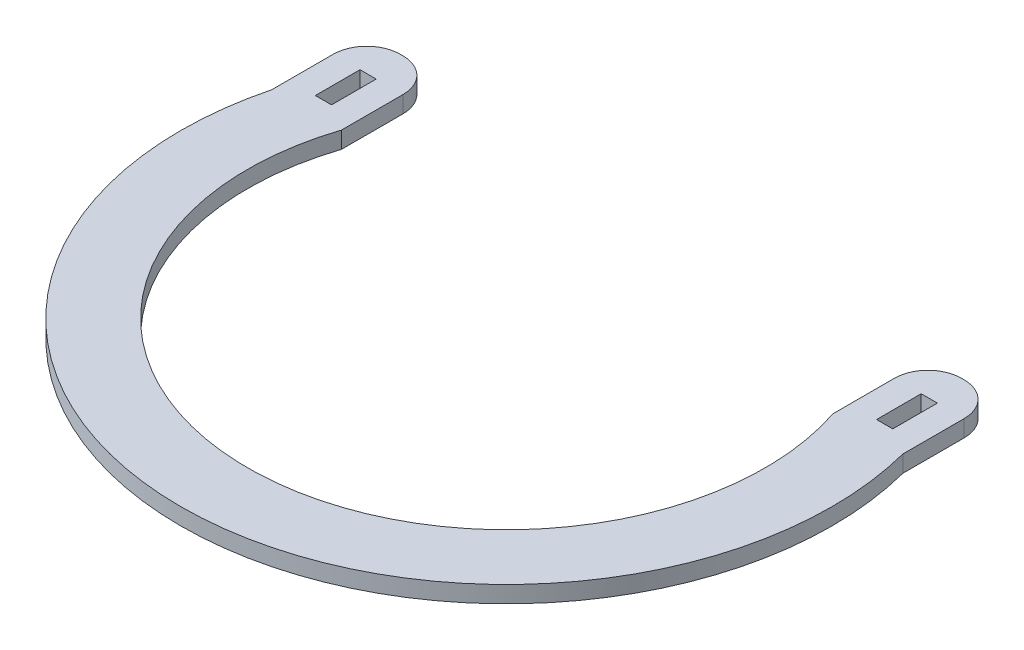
ISO-10303-21;
HEADER;
FILE_DESCRIPTION(('STEP AP214'),'2;1');
FILE_NAME('part.step','',(''),(''),'','','');
FILE_SCHEMA(('AUTOMOTIVE_DESIGN { 1 0 10303 214 1 1 1 1 }'));
ENDSEC;
DATA;
#1=APPLICATION_CONTEXT('core data for automotive mechanical design processes');
#2=APPLICATION_PROTOCOL_DEFINITION('international standard','automotive_design',2000,#1);
#3=PRODUCT_CONTEXT('',#1,'mechanical');
#4=PRODUCT('Part','Part','',(#3));
#5=PRODUCT_RELATED_PRODUCT_CATEGORY('part','',(#4));
#6=PRODUCT_DEFINITION_FORMATION('','',#4);
#7=PRODUCT_DEFINITION_CONTEXT('part definition',#1,'design');
#8=PRODUCT_DEFINITION('design','',#6,#7);
#9=PRODUCT_DEFINITION_SHAPE('','',#8);
#10=(LENGTH_UNIT() NAMED_UNIT(*) SI_UNIT(.MILLI.,.METRE.));
#11=(NAMED_UNIT(*) PLANE_ANGLE_UNIT() SI_UNIT($,.RADIAN.));
#12=(NAMED_UNIT(*) SI_UNIT($,.STERADIAN.) SOLID_ANGLE_UNIT());
#13=UNCERTAINTY_MEASURE_WITH_UNIT(LENGTH_MEASURE(1.E-05),#10,'distance_accuracy_value','');
#14=(GEOMETRIC_REPRESENTATION_CONTEXT(3) GLOBAL_UNCERTAINTY_ASSIGNED_CONTEXT((#13)) GLOBAL_UNIT_ASSIGNED_CONTEXT((#10,
#11,#12)) REPRESENTATION_CONTEXT('',''));
#15=CARTESIAN_POINT('',(0.,0.,0.));
#16=DIRECTION('',(0.,0.,1.));
#17=DIRECTION('',(1.,0.,0.));
#18=AXIS2_PLACEMENT_3D('',#15,#16,#17);
#19=CARTESIAN_POINT('',(0.,3.,14.4840771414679));
#20=DIRECTION('',(0.,1.,0.));
#21=DIRECTION('',(0.,0.,1.));
#22=AXIS2_PLACEMENT_3D('',#19,#20,#21);
#23=PLANE('',#22);
#24=CARTESIAN_POINT('',(0.,3.,14.4840771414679));
#25=DIRECTION('',(0.,-1.,0.));
#26=DIRECTION('',(0.,0.,1.));
#27=AXIS2_PLACEMENT_3D('',#24,#25,#26);
#28=CIRCLE('',#27,46.322656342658);
#29=CARTESIAN_POINT('',(44.,3.,0.));
#30=VERTEX_POINT('',#29);
#31=CARTESIAN_POINT('',(-44.,3.,0.));
#32=VERTEX_POINT('',#31);
#33=EDGE_CURVE('E237',#30,#32,#28,.T.);
#34=ORIENTED_EDGE('',*,*,#33,.T.);
#35=DIRECTION('',(0.,0.,-1.));
#36=VECTOR('',#35,1.);
#37=CARTESIAN_POINT('',(-44.,3.,0.));
#38=LINE('',#37,#36);
#39=CARTESIAN_POINT('',(-44.,3.,-11.));
#40=VERTEX_POINT('',#39);
#41=EDGE_CURVE('E240',#32,#40,#38,.T.);
#42=ORIENTED_EDGE('',*,*,#41,.T.);
#43=CARTESIAN_POINT('',(-50.,3.,-11.));
#44=DIRECTION('',(0.,1.,0.));
#45=DIRECTION('',(0.,0.,1.));
#46=AXIS2_PLACEMENT_3D('',#43,#44,#45);
#47=CIRCLE('',#46,6.);
#48=CARTESIAN_POINT('',(-50.,3.,-17.));
#49=VERTEX_POINT('',#48);
#50=EDGE_CURVE('E243',#40,#49,#47,.T.);
#51=ORIENTED_EDGE('',*,*,#50,.T.);
#52=DIRECTION('',(-1.,0.,0.));
#53=VECTOR('',#52,1.);
#54=CARTESIAN_POINT('',(-50.4955197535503,3.,-17.));
#55=LINE('',#54,#53);
#56=CARTESIAN_POINT('',(-50.4955197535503,3.,-17.));
#57=VERTEX_POINT('',#56);
#58=EDGE_CURVE('E245',#49,#57,#55,.T.);
#59=ORIENTED_EDGE('',*,*,#58,.T.);
#60=CARTESIAN_POINT('',(-50.4955197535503,3.,-11.));
#61=DIRECTION('',(0.,1.,0.));
#62=DIRECTION('',(0.,0.,-1.));
#63=AXIS2_PLACEMENT_3D('',#60,#61,#62);
#64=CIRCLE('',#63,6.);
#65=CARTESIAN_POINT('',(-56.4955197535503,3.,-11.));
#66=VERTEX_POINT('',#65);
#67=EDGE_CURVE('E247',#57,#66,#64,.T.);
#68=ORIENTED_EDGE('',*,*,#67,.T.);
#69=DIRECTION('',(0.,0.,1.));
#70=VECTOR('',#69,1.);
#71=CARTESIAN_POINT('',(-56.4955197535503,3.,0.));
#72=LINE('',#71,#70);
#73=CARTESIAN_POINT('',(-56.4955197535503,3.,0.));
#74=VERTEX_POINT('',#73);
#75=EDGE_CURVE('E249',#66,#74,#72,.T.);
#76=ORIENTED_EDGE('',*,*,#75,.T.);
#77=CARTESIAN_POINT('',(0.,3.,14.4840771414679));
#78=DIRECTION('',(0.,1.,0.));
#79=DIRECTION('',(0.,0.,1.));
#80=AXIS2_PLACEMENT_3D('',#77,#78,#79);
#81=CIRCLE('',#80,58.322656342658);
#82=CARTESIAN_POINT('',(56.4955197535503,3.,0.));
#83=VERTEX_POINT('',#82);
#84=EDGE_CURVE('E251',#74,#83,#81,.T.);
#85=ORIENTED_EDGE('',*,*,#84,.T.);
#86=DIRECTION('',(0.,0.,-1.));
#87=VECTOR('',#86,1.);
#88=CARTESIAN_POINT('',(56.4955197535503,3.,0.));
#89=LINE('',#88,#87);
#90=CARTESIAN_POINT('',(56.4955197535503,3.,-11.));
#91=VERTEX_POINT('',#90);
#92=EDGE_CURVE('E253',#83,#91,#89,.T.);
#93=ORIENTED_EDGE('',*,*,#92,.T.);
#94=CARTESIAN_POINT('',(50.4955197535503,3.,-11.));
#95=DIRECTION('',(0.,1.,0.));
#96=DIRECTION('',(0.,0.,1.));
#97=AXIS2_PLACEMENT_3D('',#94,#95,#96);
#98=CIRCLE('',#97,6.);
#99=CARTESIAN_POINT('',(50.4955197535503,3.,-17.));
#100=VERTEX_POINT('',#99);
#101=EDGE_CURVE('E255',#91,#100,#98,.T.);
#102=ORIENTED_EDGE('',*,*,#101,.T.);
#103=DIRECTION('',(-1.,0.,0.));
#104=VECTOR('',#103,1.);
#105=CARTESIAN_POINT('',(50.4955197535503,3.,-17.));
#106=LINE('',#105,#104);
#107=CARTESIAN_POINT('',(50.,3.,-17.));
#108=VERTEX_POINT('',#107);
#109=EDGE_CURVE('E257',#100,#108,#106,.T.);
#110=ORIENTED_EDGE('',*,*,#109,.T.);
#111=CARTESIAN_POINT('',(50.,3.,-11.));
#112=DIRECTION('',(0.,1.,0.));
#113=DIRECTION('',(0.,0.,-1.));
#114=AXIS2_PLACEMENT_3D('',#111,#112,#113);
#115=CIRCLE('',#114,6.);
#116=CARTESIAN_POINT('',(44.,3.,-11.));
#117=VERTEX_POINT('',#116);
#118=EDGE_CURVE('E259',#108,#117,#115,.T.);
#119=ORIENTED_EDGE('',*,*,#118,.T.);
#120=DIRECTION('',(0.,0.,1.));
#121=VECTOR('',#120,1.);
#122=CARTESIAN_POINT('',(44.,3.,0.));
#123=LINE('',#122,#121);
#124=EDGE_CURVE('E261',#117,#30,#123,.T.);
#125=ORIENTED_EDGE('',*,*,#124,.T.);
#126=EDGE_LOOP('',(#34,#42,#51,#59,#68,#76,#85,#93,#102,#110,#119,#125));
#127=FACE_BOUND('',#126,.T.);
#128=DIRECTION('',(-1.,0.,0.));
#129=VECTOR('',#128,1.);
#130=CARTESIAN_POINT('',(-51.6977598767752,3.,-11.));
#131=LINE('',#130,#129);
#132=CARTESIAN_POINT('',(-48.7977598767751,3.,-11.));
#133=VERTEX_POINT('',#132);
#134=CARTESIAN_POINT('',(-51.6977598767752,3.,-11.));
#135=VERTEX_POINT('',#134);
#136=EDGE_CURVE('E208',#133,#135,#131,.T.);
#137=ORIENTED_EDGE('',*,*,#136,.F.);
#138=DIRECTION('',(0.,0.,-1.));
#139=VECTOR('',#138,1.);
#140=CARTESIAN_POINT('',(-48.7977598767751,3.,-11.));
#141=LINE('',#140,#139);
#142=CARTESIAN_POINT('',(-48.7977598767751,3.,-3.));
#143=VERTEX_POINT('',#142);
#144=EDGE_CURVE('E206',#143,#133,#141,.T.);
#145=ORIENTED_EDGE('',*,*,#144,.F.);
#146=DIRECTION('',(1.,0.,0.));
#147=VECTOR('',#146,1.);
#148=CARTESIAN_POINT('',(-51.6977598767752,3.,-3.));
#149=LINE('',#148,#147);
#150=CARTESIAN_POINT('',(-51.6977598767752,3.,-3.));
#151=VERTEX_POINT('',#150);
#152=EDGE_CURVE('E214',#151,#143,#149,.T.);
#153=ORIENTED_EDGE('',*,*,#152,.F.);
#154=DIRECTION('',(0.,0.,1.));
#155=VECTOR('',#154,1.);
#156=CARTESIAN_POINT('',(-51.6977598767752,3.,-11.));
#157=LINE('',#156,#155);
#158=EDGE_CURVE('E211',#135,#151,#157,.T.);
#159=ORIENTED_EDGE('',*,*,#158,.F.);
#160=EDGE_LOOP('',(#137,#145,#153,#159));
#161=FACE_BOUND('',#160,.T.);
#162=DIRECTION('',(-1.,0.,0.));
#163=VECTOR('',#162,1.);
#164=CARTESIAN_POINT('',(51.6977598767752,3.,-11.));
#165=LINE('',#164,#163);
#166=CARTESIAN_POINT('',(51.6977598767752,3.,-11.));
#167=VERTEX_POINT('',#166);
#168=CARTESIAN_POINT('',(48.7977598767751,3.,-11.));
#169=VERTEX_POINT('',#168);
#170=EDGE_CURVE('E178',#167,#169,#165,.T.);
#171=ORIENTED_EDGE('',*,*,#170,.F.);
#172=DIRECTION('',(0.,0.,-1.));
#173=VECTOR('',#172,1.);
#174=CARTESIAN_POINT('',(51.6977598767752,3.,-11.));
#175=LINE('',#174,#173);
#176=CARTESIAN_POINT('',(51.6977598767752,3.,-3.));
#177=VERTEX_POINT('',#176);
#178=EDGE_CURVE('E170',#177,#167,#175,.T.);
#179=ORIENTED_EDGE('',*,*,#178,.F.);
#180=DIRECTION('',(1.,0.,0.));
#181=VECTOR('',#180,1.);
#182=CARTESIAN_POINT('',(51.6977598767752,3.,-3.));
#183=LINE('',#182,#181);
#184=CARTESIAN_POINT('',(48.7977598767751,3.,-3.));
#185=VERTEX_POINT('',#184);
#186=EDGE_CURVE('E192',#185,#177,#183,.T.);
#187=ORIENTED_EDGE('',*,*,#186,.F.);
#188=DIRECTION('',(0.,0.,1.));
#189=VECTOR('',#188,1.);
#190=CARTESIAN_POINT('',(48.7977598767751,3.,-11.));
#191=LINE('',#190,#189);
#192=EDGE_CURVE('E190',#169,#185,#191,.T.);
#193=ORIENTED_EDGE('',*,*,#192,.F.);
#194=EDGE_LOOP('',(#171,#179,#187,#193));
#195=FACE_BOUND('',#194,.T.);
#196=ADVANCED_FACE('F33',(#127,#161,#195),#23,.T.);
#197=CARTESIAN_POINT('',(0.,0.,14.4840771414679));
#198=DIRECTION('',(0.,1.,0.));
#199=DIRECTION('',(0.,0.,1.));
#200=AXIS2_PLACEMENT_3D('',#197,#198,#199);
#201=PLANE('',#200);
#202=DIRECTION('',(0.,0.,-1.));
#203=VECTOR('',#202,1.);
#204=CARTESIAN_POINT('',(-48.7977598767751,0.,-11.));
#205=LINE('',#204,#203);
#206=CARTESIAN_POINT('',(-48.7977598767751,0.,-3.));
#207=VERTEX_POINT('',#206);
#208=CARTESIAN_POINT('',(-48.7977598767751,0.,-11.));
#209=VERTEX_POINT('',#208);
#210=EDGE_CURVE('E186',#207,#209,#205,.T.);
#211=ORIENTED_EDGE('',*,*,#210,.T.);
#212=DIRECTION('',(-1.,0.,0.));
#213=VECTOR('',#212,1.);
#214=CARTESIAN_POINT('',(-51.6977598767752,0.,-11.));
#215=LINE('',#214,#213);
#216=CARTESIAN_POINT('',(-51.6977598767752,0.,-11.));
#217=VERTEX_POINT('',#216);
#218=EDGE_CURVE('E219',#209,#217,#215,.T.);
#219=ORIENTED_EDGE('',*,*,#218,.T.);
#220=DIRECTION('',(0.,0.,1.));
#221=VECTOR('',#220,1.);
#222=CARTESIAN_POINT('',(-51.6977598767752,0.,-11.));
#223=LINE('',#222,#221);
#224=CARTESIAN_POINT('',(-51.6977598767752,0.,-3.));
#225=VERTEX_POINT('',#224);
#226=EDGE_CURVE('E222',#217,#225,#223,.T.);
#227=ORIENTED_EDGE('',*,*,#226,.T.);
#228=DIRECTION('',(1.,0.,0.));
#229=VECTOR('',#228,1.);
#230=CARTESIAN_POINT('',(-51.6977598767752,0.,-3.));
#231=LINE('',#230,#229);
#232=EDGE_CURVE('E209',#225,#207,#231,.T.);
#233=ORIENTED_EDGE('',*,*,#232,.T.);
#234=EDGE_LOOP('',(#211,#219,#227,#233));
#235=FACE_BOUND('',#234,.T.);
#236=CARTESIAN_POINT('',(0.,0.,14.4840771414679));
#237=DIRECTION('',(0.,-1.,0.));
#238=DIRECTION('',(0.,0.,1.));
#239=AXIS2_PLACEMENT_3D('',#236,#237,#238);
#240=CIRCLE('',#239,46.322656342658);
#241=CARTESIAN_POINT('',(44.,0.,0.));
#242=VERTEX_POINT('',#241);
#243=CARTESIAN_POINT('',(-44.,0.,0.));
#244=VERTEX_POINT('',#243);
#245=EDGE_CURVE('E236',#242,#244,#240,.T.);
#246=ORIENTED_EDGE('',*,*,#245,.F.);
#247=DIRECTION('',(0.,0.,1.));
#248=VECTOR('',#247,1.);
#249=CARTESIAN_POINT('',(44.,0.,0.));
#250=LINE('',#249,#248);
#251=CARTESIAN_POINT('',(44.,0.,-11.));
#252=VERTEX_POINT('',#251);
#253=EDGE_CURVE('E241',#252,#242,#250,.T.);
#254=ORIENTED_EDGE('',*,*,#253,.F.);
#255=CARTESIAN_POINT('',(50.,0.,-11.));
#256=DIRECTION('',(0.,1.,0.));
#257=DIRECTION('',(0.,0.,-1.));
#258=AXIS2_PLACEMENT_3D('',#255,#256,#257);
#259=CIRCLE('',#258,6.);
#260=CARTESIAN_POINT('',(50.,0.,-17.));
#261=VERTEX_POINT('',#260);
#262=EDGE_CURVE('E284',#261,#252,#259,.T.);
#263=ORIENTED_EDGE('',*,*,#262,.F.);
#264=DIRECTION('',(-1.,0.,0.));
#265=VECTOR('',#264,1.);
#266=CARTESIAN_POINT('',(50.4955197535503,0.,-17.));
#267=LINE('',#266,#265);
#268=CARTESIAN_POINT('',(50.4955197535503,0.,-17.));
#269=VERTEX_POINT('',#268);
#270=EDGE_CURVE('E282',#269,#261,#267,.T.);
#271=ORIENTED_EDGE('',*,*,#270,.F.);
#272=CARTESIAN_POINT('',(50.4955197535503,0.,-11.));
#273=DIRECTION('',(0.,1.,0.));
#274=DIRECTION('',(0.,0.,1.));
#275=AXIS2_PLACEMENT_3D('',#272,#273,#274);
#276=CIRCLE('',#275,6.);
#277=CARTESIAN_POINT('',(56.4955197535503,0.,-11.));
#278=VERTEX_POINT('',#277);
#279=EDGE_CURVE('E280',#278,#269,#276,.T.);
#280=ORIENTED_EDGE('',*,*,#279,.F.);
#281=DIRECTION('',(0.,0.,-1.));
#282=VECTOR('',#281,1.);
#283=CARTESIAN_POINT('',(56.4955197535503,0.,0.));
#284=LINE('',#283,#282);
#285=CARTESIAN_POINT('',(56.4955197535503,0.,0.));
#286=VERTEX_POINT('',#285);
#287=EDGE_CURVE('E278',#286,#278,#284,.T.);
#288=ORIENTED_EDGE('',*,*,#287,.F.);
#289=CARTESIAN_POINT('',(0.,0.,14.4840771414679));
#290=DIRECTION('',(0.,1.,0.));
#291=DIRECTION('',(0.,0.,1.));
#292=AXIS2_PLACEMENT_3D('',#289,#290,#291);
#293=CIRCLE('',#292,58.322656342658);
#294=CARTESIAN_POINT('',(-56.4955197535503,0.,0.));
#295=VERTEX_POINT('',#294);
#296=EDGE_CURVE('E276',#295,#286,#293,.T.);
#297=ORIENTED_EDGE('',*,*,#296,.F.);
#298=DIRECTION('',(0.,0.,1.));
#299=VECTOR('',#298,1.);
#300=CARTESIAN_POINT('',(-56.4955197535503,0.,0.));
#301=LINE('',#300,#299);
#302=CARTESIAN_POINT('',(-56.4955197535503,0.,-11.));
#303=VERTEX_POINT('',#302);
#304=EDGE_CURVE('E274',#303,#295,#301,.T.);
#305=ORIENTED_EDGE('',*,*,#304,.F.);
#306=CARTESIAN_POINT('',(-50.4955197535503,0.,-11.));
#307=DIRECTION('',(0.,1.,0.));
#308=DIRECTION('',(0.,0.,-1.));
#309=AXIS2_PLACEMENT_3D('',#306,#307,#308);
#310=CIRCLE('',#309,6.);
#311=CARTESIAN_POINT('',(-50.4955197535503,0.,-17.));
#312=VERTEX_POINT('',#311);
#313=EDGE_CURVE('E272',#312,#303,#310,.T.);
#314=ORIENTED_EDGE('',*,*,#313,.F.);
#315=DIRECTION('',(-1.,0.,0.));
#316=VECTOR('',#315,1.);
#317=CARTESIAN_POINT('',(-50.4955197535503,0.,-17.));
#318=LINE('',#317,#316);
#319=CARTESIAN_POINT('',(-50.,0.,-17.));
#320=VERTEX_POINT('',#319);
#321=EDGE_CURVE('E270',#320,#312,#318,.T.);
#322=ORIENTED_EDGE('',*,*,#321,.F.);
#323=CARTESIAN_POINT('',(-50.,0.,-11.));
#324=DIRECTION('',(0.,1.,0.));
#325=DIRECTION('',(0.,0.,1.));
#326=AXIS2_PLACEMENT_3D('',#323,#324,#325);
#327=CIRCLE('',#326,6.);
#328=CARTESIAN_POINT('',(-44.,0.,-11.));
#329=VERTEX_POINT('',#328);
#330=EDGE_CURVE('E268',#329,#320,#327,.T.);
#331=ORIENTED_EDGE('',*,*,#330,.F.);
#332=DIRECTION('',(0.,0.,-1.));
#333=VECTOR('',#332,1.);
#334=CARTESIAN_POINT('',(-44.,0.,0.));
#335=LINE('',#334,#333);
#336=EDGE_CURVE('E266',#244,#329,#335,.T.);
#337=ORIENTED_EDGE('',*,*,#336,.F.);
#338=EDGE_LOOP('',(#246,#254,#263,#271,#280,#288,#297,#305,#314,#322,#331,#337));
#339=FACE_BOUND('',#338,.T.);
#340=DIRECTION('',(0.,0.,-1.));
#341=VECTOR('',#340,1.);
#342=CARTESIAN_POINT('',(51.6977598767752,0.,-11.));
#343=LINE('',#342,#341);
#344=CARTESIAN_POINT('',(51.6977598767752,0.,-3.));
#345=VERTEX_POINT('',#344);
#346=CARTESIAN_POINT('',(51.6977598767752,0.,-11.));
#347=VERTEX_POINT('',#346);
#348=EDGE_CURVE('E56',#345,#347,#343,.T.);
#349=ORIENTED_EDGE('',*,*,#348,.T.);
#350=DIRECTION('',(-1.,0.,0.));
#351=VECTOR('',#350,1.);
#352=CARTESIAN_POINT('',(51.6977598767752,0.,-11.));
#353=LINE('',#352,#351);
#354=CARTESIAN_POINT('',(48.7977598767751,0.,-11.));
#355=VERTEX_POINT('',#354);
#356=EDGE_CURVE('E185',#347,#355,#353,.T.);
#357=ORIENTED_EDGE('',*,*,#356,.T.);
#358=DIRECTION('',(0.,0.,1.));
#359=VECTOR('',#358,1.);
#360=CARTESIAN_POINT('',(48.7977598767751,0.,-11.));
#361=LINE('',#360,#359);
#362=CARTESIAN_POINT('',(48.7977598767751,0.,-3.));
#363=VERTEX_POINT('',#362);
#364=EDGE_CURVE('E198',#355,#363,#361,.T.);
#365=ORIENTED_EDGE('',*,*,#364,.T.);
#366=DIRECTION('',(1.,0.,0.));
#367=VECTOR('',#366,1.);
#368=CARTESIAN_POINT('',(51.6977598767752,0.,-3.));
#369=LINE('',#368,#367);
#370=EDGE_CURVE('E179',#363,#345,#369,.T.);
#371=ORIENTED_EDGE('',*,*,#370,.T.);
#372=EDGE_LOOP('',(#349,#357,#365,#371));
#373=FACE_BOUND('',#372,.T.);
#374=ADVANCED_FACE('F326',(#235,#339,#373),#201,.F.);
#375=CARTESIAN_POINT('',(0.,3.,14.4840771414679));
#376=DIRECTION('',(0.,-1.,0.));
#377=DIRECTION('',(0.,0.,-1.));
#378=AXIS2_PLACEMENT_3D('',#375,#376,#377);
#379=CYLINDRICAL_SURFACE('',#378,46.322656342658);
#380=ORIENTED_EDGE('',*,*,#245,.T.);
#381=DIRECTION('',(0.,-1.,0.));
#382=VECTOR('',#381,1.);
#383=CARTESIAN_POINT('',(-44.,3.,0.));
#384=LINE('',#383,#382);
#385=EDGE_CURVE('E11',#32,#244,#384,.T.);
#386=ORIENTED_EDGE('',*,*,#385,.F.);
#387=ORIENTED_EDGE('',*,*,#33,.F.);
#388=DIRECTION('',(0.,-1.,0.));
#389=VECTOR('',#388,1.);
#390=CARTESIAN_POINT('',(44.,3.,0.));
#391=LINE('',#390,#389);
#392=EDGE_CURVE('E263',#30,#242,#391,.T.);
#393=ORIENTED_EDGE('',*,*,#392,.T.);
#394=EDGE_LOOP('',(#380,#386,#387,#393));
#395=FACE_BOUND('',#394,.T.);
#396=ADVANCED_FACE('F35',(#395),#379,.F.);
#397=CARTESIAN_POINT('',(-44.,3.,0.));
#398=DIRECTION('',(-1.,0.,0.));
#399=DIRECTION('',(0.,0.,1.));
#400=AXIS2_PLACEMENT_3D('',#397,#398,#399);
#401=PLANE('',#400);
#402=ORIENTED_EDGE('',*,*,#336,.T.);
#403=DIRECTION('',(0.,-1.,0.));
#404=VECTOR('',#403,1.);
#405=CARTESIAN_POINT('',(-44.,3.,-11.));
#406=LINE('',#405,#404);
#407=EDGE_CURVE('E41',#40,#329,#406,.T.);
#408=ORIENTED_EDGE('',*,*,#407,.F.);
#409=ORIENTED_EDGE('',*,*,#41,.F.);
#410=ORIENTED_EDGE('',*,*,#385,.T.);
#411=EDGE_LOOP('',(#402,#408,#409,#410));
#412=FACE_BOUND('',#411,.T.);
#413=ADVANCED_FACE('F344',(#412),#401,.F.);
#414=CARTESIAN_POINT('',(-50.,3.,-11.));
#415=DIRECTION('',(0.,-1.,0.));
#416=DIRECTION('',(0.,0.,-1.));
#417=AXIS2_PLACEMENT_3D('',#414,#415,#416);
#418=CYLINDRICAL_SURFACE('',#417,6.);
#419=ORIENTED_EDGE('',*,*,#330,.T.);
#420=DIRECTION('',(0.,-1.,0.));
#421=VECTOR('',#420,1.);
#422=CARTESIAN_POINT('',(-50.,3.,-17.));
#423=LINE('',#422,#421);
#424=EDGE_CURVE('E313',#49,#320,#423,.T.);
#425=ORIENTED_EDGE('',*,*,#424,.F.);
#426=ORIENTED_EDGE('',*,*,#50,.F.);
#427=ORIENTED_EDGE('',*,*,#407,.T.);
#428=EDGE_LOOP('',(#419,#425,#426,#427));
#429=FACE_BOUND('',#428,.T.);
#430=ADVANCED_FACE('F320',(#429),#418,.T.);
#431=CARTESIAN_POINT('',(-50.4955197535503,3.,-17.));
#432=DIRECTION('',(0.,0.,1.));
#433=DIRECTION('',(1.,0.,0.));
#434=AXIS2_PLACEMENT_3D('',#431,#432,#433);
#435=PLANE('',#434);
#436=ORIENTED_EDGE('',*,*,#321,.T.);
#437=DIRECTION('',(0.,-1.,0.));
#438=VECTOR('',#437,1.);
#439=CARTESIAN_POINT('',(-50.4955197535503,3.,-17.));
#440=LINE('',#439,#438);
#441=EDGE_CURVE('E310',#57,#312,#440,.T.);
#442=ORIENTED_EDGE('',*,*,#441,.F.);
#443=ORIENTED_EDGE('',*,*,#58,.F.);
#444=ORIENTED_EDGE('',*,*,#424,.T.);
#445=EDGE_LOOP('',(#436,#442,#443,#444));
#446=FACE_BOUND('',#445,.T.);
#447=ADVANCED_FACE('F332',(#446),#435,.F.);
#448=CARTESIAN_POINT('',(-50.4955197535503,3.,-11.));
#449=DIRECTION('',(0.,-1.,0.));
#450=DIRECTION('',(0.,0.,-1.));
#451=AXIS2_PLACEMENT_3D('',#448,#449,#450);
#452=CYLINDRICAL_SURFACE('',#451,6.);
#453=ORIENTED_EDGE('',*,*,#313,.T.);
#454=DIRECTION('',(0.,-1.,0.));
#455=VECTOR('',#454,1.);
#456=CARTESIAN_POINT('',(-56.4955197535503,3.,-11.));
#457=LINE('',#456,#455);
#458=EDGE_CURVE('E307',#66,#303,#457,.T.);
#459=ORIENTED_EDGE('',*,*,#458,.F.);
#460=ORIENTED_EDGE('',*,*,#67,.F.);
#461=ORIENTED_EDGE('',*,*,#441,.T.);
#462=EDGE_LOOP('',(#453,#459,#460,#461));
#463=FACE_BOUND('',#462,.T.);
#464=ADVANCED_FACE('F336',(#463),#452,.T.);
#465=CARTESIAN_POINT('',(-56.4955197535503,3.,0.));
#466=DIRECTION('',(1.,0.,0.));
#467=DIRECTION('',(0.,0.,-1.));
#468=AXIS2_PLACEMENT_3D('',#465,#466,#467);
#469=PLANE('',#468);
#470=ORIENTED_EDGE('',*,*,#304,.T.);
#471=DIRECTION('',(0.,-1.,0.));
#472=VECTOR('',#471,1.);
#473=CARTESIAN_POINT('',(-56.4955197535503,3.,0.));
#474=LINE('',#473,#472);
#475=EDGE_CURVE('E304',#74,#295,#474,.T.);
#476=ORIENTED_EDGE('',*,*,#475,.F.);
#477=ORIENTED_EDGE('',*,*,#75,.F.);
#478=ORIENTED_EDGE('',*,*,#458,.T.);
#479=EDGE_LOOP('',(#470,#476,#477,#478));
#480=FACE_BOUND('',#479,.T.);
#481=ADVANCED_FACE('F377',(#480),#469,.F.);
#482=CARTESIAN_POINT('',(0.,3.,14.4840771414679));
#483=DIRECTION('',(0.,-1.,0.));
#484=DIRECTION('',(0.,0.,-1.));
#485=AXIS2_PLACEMENT_3D('',#482,#483,#484);
#486=CYLINDRICAL_SURFACE('',#485,58.322656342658);
#487=ORIENTED_EDGE('',*,*,#296,.T.);
#488=DIRECTION('',(0.,-1.,0.));
#489=VECTOR('',#488,1.);
#490=CARTESIAN_POINT('',(56.4955197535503,3.,0.));
#491=LINE('',#490,#489);
#492=EDGE_CURVE('E301',#83,#286,#491,.T.);
#493=ORIENTED_EDGE('',*,*,#492,.F.);
#494=ORIENTED_EDGE('',*,*,#84,.F.);
#495=ORIENTED_EDGE('',*,*,#475,.T.);
#496=EDGE_LOOP('',(#487,#493,#494,#495));
#497=FACE_BOUND('',#496,.T.);
#498=ADVANCED_FACE('F375',(#497),#486,.T.);
#499=CARTESIAN_POINT('',(56.4955197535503,3.,0.));
#500=DIRECTION('',(-1.,0.,0.));
#501=DIRECTION('',(0.,0.,1.));
#502=AXIS2_PLACEMENT_3D('',#499,#500,#501);
#503=PLANE('',#502);
#504=ORIENTED_EDGE('',*,*,#287,.T.);
#505=DIRECTION('',(0.,-1.,0.));
#506=VECTOR('',#505,1.);
#507=CARTESIAN_POINT('',(56.4955197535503,3.,-11.));
#508=LINE('',#507,#506);
#509=EDGE_CURVE('E298',#91,#278,#508,.T.);
#510=ORIENTED_EDGE('',*,*,#509,.F.);
#511=ORIENTED_EDGE('',*,*,#92,.F.);
#512=ORIENTED_EDGE('',*,*,#492,.T.);
#513=EDGE_LOOP('',(#504,#510,#511,#512));
#514=FACE_BOUND('',#513,.T.);
#515=ADVANCED_FACE('F371',(#514),#503,.F.);
#516=CARTESIAN_POINT('',(50.4955197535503,3.,-11.));
#517=DIRECTION('',(0.,-1.,0.));
#518=DIRECTION('',(0.,0.,-1.));
#519=AXIS2_PLACEMENT_3D('',#516,#517,#518);
#520=CYLINDRICAL_SURFACE('',#519,6.);
#521=ORIENTED_EDGE('',*,*,#279,.T.);
#522=DIRECTION('',(0.,-1.,0.));
#523=VECTOR('',#522,1.);
#524=CARTESIAN_POINT('',(50.4955197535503,3.,-17.));
#525=LINE('',#524,#523);
#526=EDGE_CURVE('E295',#100,#269,#525,.T.);
#527=ORIENTED_EDGE('',*,*,#526,.F.);
#528=ORIENTED_EDGE('',*,*,#101,.F.);
#529=ORIENTED_EDGE('',*,*,#509,.T.);
#530=EDGE_LOOP('',(#521,#527,#528,#529));
#531=FACE_BOUND('',#530,.T.);
#532=ADVANCED_FACE('F366',(#531),#520,.T.);
#533=CARTESIAN_POINT('',(50.4955197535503,3.,-17.));
#534=DIRECTION('',(0.,0.,1.));
#535=DIRECTION('',(1.,0.,0.));
#536=AXIS2_PLACEMENT_3D('',#533,#534,#535);
#537=PLANE('',#536);
#538=ORIENTED_EDGE('',*,*,#270,.T.);
#539=DIRECTION('',(0.,-1.,0.));
#540=VECTOR('',#539,1.);
#541=CARTESIAN_POINT('',(50.,3.,-17.));
#542=LINE('',#541,#540);
#543=EDGE_CURVE('E292',#108,#261,#542,.T.);
#544=ORIENTED_EDGE('',*,*,#543,.F.);
#545=ORIENTED_EDGE('',*,*,#109,.F.);
#546=ORIENTED_EDGE('',*,*,#526,.T.);
#547=EDGE_LOOP('',(#538,#544,#545,#546));
#548=FACE_BOUND('',#547,.T.);
#549=ADVANCED_FACE('F360',(#548),#537,.F.);
#550=CARTESIAN_POINT('',(50.,3.,-11.));
#551=DIRECTION('',(0.,-1.,0.));
#552=DIRECTION('',(0.,0.,-1.));
#553=AXIS2_PLACEMENT_3D('',#550,#551,#552);
#554=CYLINDRICAL_SURFACE('',#553,6.);
#555=ORIENTED_EDGE('',*,*,#262,.T.);
#556=DIRECTION('',(0.,-1.,0.));
#557=VECTOR('',#556,1.);
#558=CARTESIAN_POINT('',(44.,3.,-11.));
#559=LINE('',#558,#557);
#560=EDGE_CURVE('E289',#117,#252,#559,.T.);
#561=ORIENTED_EDGE('',*,*,#560,.F.);
#562=ORIENTED_EDGE('',*,*,#118,.F.);
#563=ORIENTED_EDGE('',*,*,#543,.T.);
#564=EDGE_LOOP('',(#555,#561,#562,#563));
#565=FACE_BOUND('',#564,.T.);
#566=ADVANCED_FACE('F356',(#565),#554,.T.);
#567=CARTESIAN_POINT('',(44.,3.,0.));
#568=DIRECTION('',(1.,0.,0.));
#569=DIRECTION('',(0.,0.,-1.));
#570=AXIS2_PLACEMENT_3D('',#567,#568,#569);
#571=PLANE('',#570);
#572=ORIENTED_EDGE('',*,*,#253,.T.);
#573=ORIENTED_EDGE('',*,*,#392,.F.);
#574=ORIENTED_EDGE('',*,*,#124,.F.);
#575=ORIENTED_EDGE('',*,*,#560,.T.);
#576=EDGE_LOOP('',(#572,#573,#574,#575));
#577=FACE_BOUND('',#576,.T.);
#578=ADVANCED_FACE('F351',(#577),#571,.F.);
#579=CARTESIAN_POINT('',(-48.7977598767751,3.,-11.));
#580=DIRECTION('',(-1.,0.,0.));
#581=DIRECTION('',(0.,0.,1.));
#582=AXIS2_PLACEMENT_3D('',#579,#580,#581);
#583=PLANE('',#582);
#584=ORIENTED_EDGE('',*,*,#210,.F.);
#585=DIRECTION('',(0.,-1.,0.));
#586=VECTOR('',#585,1.);
#587=CARTESIAN_POINT('',(-48.7977598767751,3.,-3.));
#588=LINE('',#587,#586);
#589=EDGE_CURVE('E216',#143,#207,#588,.T.);
#590=ORIENTED_EDGE('',*,*,#589,.F.);
#591=ORIENTED_EDGE('',*,*,#144,.T.);
#592=DIRECTION('',(0.,-1.,0.));
#593=VECTOR('',#592,1.);
#594=CARTESIAN_POINT('',(-48.7977598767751,3.,-11.));
#595=LINE('',#594,#593);
#596=EDGE_CURVE('E233',#133,#209,#595,.T.);
#597=ORIENTED_EDGE('',*,*,#596,.T.);
#598=EDGE_LOOP('',(#584,#590,#591,#597));
#599=FACE_BOUND('',#598,.T.);
#600=ADVANCED_FACE('F394',(#599),#583,.T.);
#601=CARTESIAN_POINT('',(-51.6977598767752,3.,-11.));
#602=DIRECTION('',(0.,0.,1.));
#603=DIRECTION('',(1.,0.,0.));
#604=AXIS2_PLACEMENT_3D('',#601,#602,#603);
#605=PLANE('',#604);
#606=ORIENTED_EDGE('',*,*,#218,.F.);
#607=ORIENTED_EDGE('',*,*,#596,.F.);
#608=ORIENTED_EDGE('',*,*,#136,.T.);
#609=DIRECTION('',(0.,-1.,0.));
#610=VECTOR('',#609,1.);
#611=CARTESIAN_POINT('',(-51.6977598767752,3.,-11.));
#612=LINE('',#611,#610);
#613=EDGE_CURVE('E231',#135,#217,#612,.T.);
#614=ORIENTED_EDGE('',*,*,#613,.T.);
#615=EDGE_LOOP('',(#606,#607,#608,#614));
#616=FACE_BOUND('',#615,.T.);
#617=ADVANCED_FACE('F432',(#616),#605,.T.);
#618=CARTESIAN_POINT('',(-51.6977598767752,3.,-11.));
#619=DIRECTION('',(1.,0.,0.));
#620=DIRECTION('',(0.,0.,-1.));
#621=AXIS2_PLACEMENT_3D('',#618,#619,#620);
#622=PLANE('',#621);
#623=ORIENTED_EDGE('',*,*,#226,.F.);
#624=ORIENTED_EDGE('',*,*,#613,.F.);
#625=ORIENTED_EDGE('',*,*,#158,.T.);
#626=DIRECTION('',(0.,-1.,0.));
#627=VECTOR('',#626,1.);
#628=CARTESIAN_POINT('',(-51.6977598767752,3.,-3.));
#629=LINE('',#628,#627);
#630=EDGE_CURVE('E229',#151,#225,#629,.T.);
#631=ORIENTED_EDGE('',*,*,#630,.T.);
#632=EDGE_LOOP('',(#623,#624,#625,#631));
#633=FACE_BOUND('',#632,.T.);
#634=ADVANCED_FACE('F439',(#633),#622,.T.);
#635=CARTESIAN_POINT('',(-51.6977598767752,3.,-3.));
#636=DIRECTION('',(0.,0.,-1.));
#637=DIRECTION('',(-1.,0.,0.));
#638=AXIS2_PLACEMENT_3D('',#635,#636,#637);
#639=PLANE('',#638);
#640=ORIENTED_EDGE('',*,*,#232,.F.);
#641=ORIENTED_EDGE('',*,*,#630,.F.);
#642=ORIENTED_EDGE('',*,*,#152,.T.);
#643=ORIENTED_EDGE('',*,*,#589,.T.);
#644=EDGE_LOOP('',(#640,#641,#642,#643));
#645=FACE_BOUND('',#644,.T.);
#646=ADVANCED_FACE('F446',(#645),#639,.T.);
#647=CARTESIAN_POINT('',(51.6977598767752,3.,-11.));
#648=DIRECTION('',(-1.,0.,0.));
#649=DIRECTION('',(0.,0.,1.));
#650=AXIS2_PLACEMENT_3D('',#647,#648,#649);
#651=PLANE('',#650);
#652=ORIENTED_EDGE('',*,*,#348,.F.);
#653=DIRECTION('',(0.,-1.,0.));
#654=VECTOR('',#653,1.);
#655=CARTESIAN_POINT('',(51.6977598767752,3.,-3.));
#656=LINE('',#655,#654);
#657=EDGE_CURVE('E174',#177,#345,#656,.T.);
#658=ORIENTED_EDGE('',*,*,#657,.F.);
#659=ORIENTED_EDGE('',*,*,#178,.T.);
#660=DIRECTION('',(0.,-1.,0.));
#661=VECTOR('',#660,1.);
#662=CARTESIAN_POINT('',(51.6977598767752,3.,-11.));
#663=LINE('',#662,#661);
#664=EDGE_CURVE('E173',#167,#347,#663,.T.);
#665=ORIENTED_EDGE('',*,*,#664,.T.);
#666=EDGE_LOOP('',(#652,#658,#659,#665));
#667=FACE_BOUND('',#666,.T.);
#668=ADVANCED_FACE('F172',(#667),#651,.T.);
#669=CARTESIAN_POINT('',(51.6977598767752,3.,-11.));
#670=DIRECTION('',(0.,0.,1.));
#671=DIRECTION('',(1.,0.,0.));
#672=AXIS2_PLACEMENT_3D('',#669,#670,#671);
#673=PLANE('',#672);
#674=ORIENTED_EDGE('',*,*,#356,.F.);
#675=ORIENTED_EDGE('',*,*,#664,.F.);
#676=ORIENTED_EDGE('',*,*,#170,.T.);
#677=DIRECTION('',(0.,-1.,0.));
#678=VECTOR('',#677,1.);
#679=CARTESIAN_POINT('',(48.7977598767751,3.,-11.));
#680=LINE('',#679,#678);
#681=EDGE_CURVE('E187',#169,#355,#680,.T.);
#682=ORIENTED_EDGE('',*,*,#681,.T.);
#683=EDGE_LOOP('',(#674,#675,#676,#682));
#684=FACE_BOUND('',#683,.T.);
#685=ADVANCED_FACE('F182',(#684),#673,.T.);
#686=CARTESIAN_POINT('',(48.7977598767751,3.,-11.));
#687=DIRECTION('',(1.,0.,0.));
#688=DIRECTION('',(0.,0.,-1.));
#689=AXIS2_PLACEMENT_3D('',#686,#687,#688);
#690=PLANE('',#689);
#691=ORIENTED_EDGE('',*,*,#364,.F.);
#692=ORIENTED_EDGE('',*,*,#681,.F.);
#693=ORIENTED_EDGE('',*,*,#192,.T.);
#694=DIRECTION('',(0.,-1.,0.));
#695=VECTOR('',#694,1.);
#696=CARTESIAN_POINT('',(48.7977598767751,3.,-3.));
#697=LINE('',#696,#695);
#698=EDGE_CURVE('E48',#185,#363,#697,.T.);
#699=ORIENTED_EDGE('',*,*,#698,.T.);
#700=EDGE_LOOP('',(#691,#692,#693,#699));
#701=FACE_BOUND('',#700,.T.);
#702=ADVANCED_FACE('F467',(#701),#690,.T.);
#703=CARTESIAN_POINT('',(51.6977598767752,3.,-3.));
#704=DIRECTION('',(0.,0.,-1.));
#705=DIRECTION('',(-1.,0.,0.));
#706=AXIS2_PLACEMENT_3D('',#703,#704,#705);
#707=PLANE('',#706);
#708=ORIENTED_EDGE('',*,*,#370,.F.);
#709=ORIENTED_EDGE('',*,*,#698,.F.);
#710=ORIENTED_EDGE('',*,*,#186,.T.);
#711=ORIENTED_EDGE('',*,*,#657,.T.);
#712=EDGE_LOOP('',(#708,#709,#710,#711));
#713=FACE_BOUND('',#712,.T.);
#714=ADVANCED_FACE('F474',(#713),#707,.T.);
#715=CLOSED_SHELL('',(#196,#374,#396,#413,#430,#447,#464,#481,#498,#515,#532,#549,#566,#578,
#600,#617,#634,#646,#668,#685,#702,#714));
#716=MANIFOLD_SOLID_BREP('B2',#715);
#717=ADVANCED_BREP_SHAPE_REPRESENTATION('',(#18,#716),#14);
#718=SHAPE_DEFINITION_REPRESENTATION(#9,#717);
ENDSEC;
END-ISO-10303-21;
